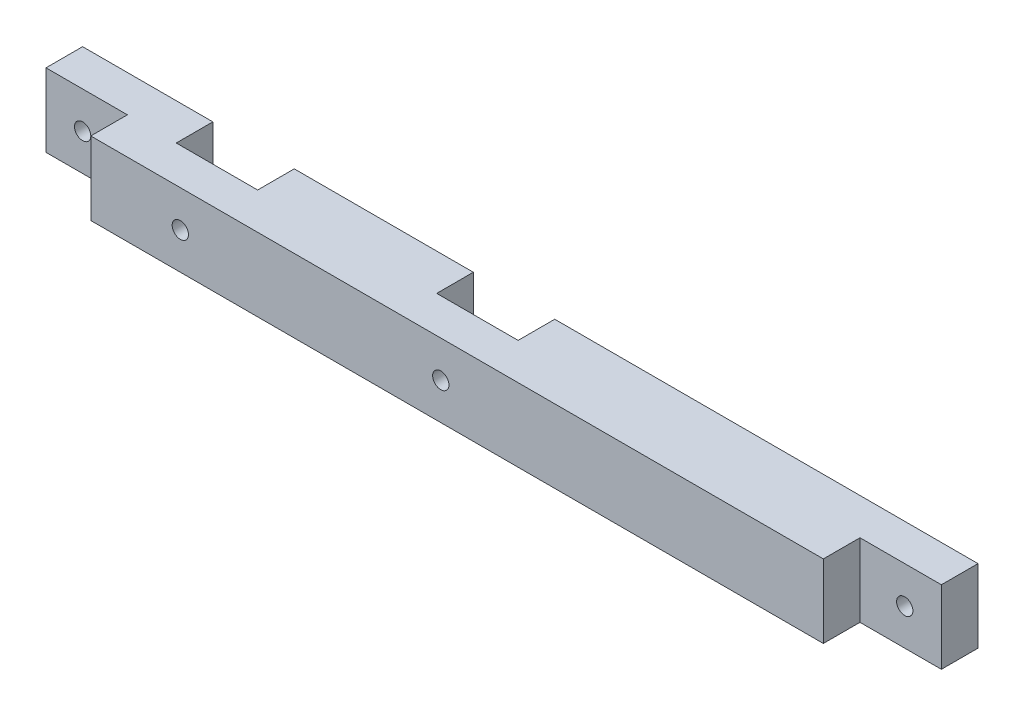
ISO-10303-21;
HEADER;
FILE_DESCRIPTION(('STEP AP214'),'2;1');
FILE_NAME('part.step','',(''),(''),'','','');
FILE_SCHEMA(('AUTOMOTIVE_DESIGN { 1 0 10303 214 1 1 1 1 }'));
ENDSEC;
DATA;
#1=APPLICATION_CONTEXT('core data for automotive mechanical design processes');
#2=APPLICATION_PROTOCOL_DEFINITION('international standard','automotive_design',2000,#1);
#3=PRODUCT_CONTEXT('',#1,'mechanical');
#4=PRODUCT('Part','Part','',(#3));
#5=PRODUCT_RELATED_PRODUCT_CATEGORY('part','',(#4));
#6=PRODUCT_DEFINITION_FORMATION('','',#4);
#7=PRODUCT_DEFINITION_CONTEXT('part definition',#1,'design');
#8=PRODUCT_DEFINITION('design','',#6,#7);
#9=PRODUCT_DEFINITION_SHAPE('','',#8);
#10=(LENGTH_UNIT() NAMED_UNIT(*) SI_UNIT(.MILLI.,.METRE.));
#11=(NAMED_UNIT(*) PLANE_ANGLE_UNIT() SI_UNIT($,.RADIAN.));
#12=(NAMED_UNIT(*) SI_UNIT($,.STERADIAN.) SOLID_ANGLE_UNIT());
#13=UNCERTAINTY_MEASURE_WITH_UNIT(LENGTH_MEASURE(1.E-05),#10,'distance_accuracy_value','');
#14=(GEOMETRIC_REPRESENTATION_CONTEXT(3) GLOBAL_UNCERTAINTY_ASSIGNED_CONTEXT((#13)) GLOBAL_UNIT_ASSIGNED_CONTEXT((#10,
#11,#12)) REPRESENTATION_CONTEXT('',''));
#15=CARTESIAN_POINT('',(0.,0.,0.));
#16=DIRECTION('',(0.,0.,1.));
#17=DIRECTION('',(1.,0.,0.));
#18=AXIS2_PLACEMENT_3D('',#15,#16,#17);
#19=CARTESIAN_POINT('',(-67.2716845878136,-100.617562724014,0.));
#20=DIRECTION('',(0.,0.,-1.));
#21=DIRECTION('',(-1.,0.,0.));
#22=AXIS2_PLACEMENT_3D('',#19,#20,#21);
#23=PLANE('',#22);
#24=DIRECTION('',(0.,1.,0.));
#25=VECTOR('',#24,1.);
#26=CARTESIAN_POINT('',(-19.2716845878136,-100.617562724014,0.));
#27=LINE('',#26,#25);
#28=CARTESIAN_POINT('',(-19.2716845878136,-109.617562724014,0.));
#29=VERTEX_POINT('',#28);
#30=CARTESIAN_POINT('',(-19.2716845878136,-100.617562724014,0.));
#31=VERTEX_POINT('',#30);
#32=EDGE_CURVE('E149',#29,#31,#27,.T.);
#33=ORIENTED_EDGE('',*,*,#32,.F.);
#34=DIRECTION('',(1.,0.,0.));
#35=VECTOR('',#34,1.);
#36=CARTESIAN_POINT('',(-67.2716845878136,-109.617562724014,0.));
#37=LINE('',#36,#35);
#38=CARTESIAN_POINT('',(-41.2716845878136,-109.617562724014,0.));
#39=VERTEX_POINT('',#38);
#40=EDGE_CURVE('E267',#39,#29,#37,.T.);
#41=ORIENTED_EDGE('',*,*,#40,.F.);
#42=DIRECTION('',(0.,-1.,0.));
#43=VECTOR('',#42,1.);
#44=CARTESIAN_POINT('',(-41.2716845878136,-100.617562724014,0.));
#45=LINE('',#44,#43);
#46=CARTESIAN_POINT('',(-41.2716845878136,-100.617562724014,0.));
#47=VERTEX_POINT('',#46);
#48=EDGE_CURVE('E184',#47,#39,#45,.T.);
#49=ORIENTED_EDGE('',*,*,#48,.F.);
#50=DIRECTION('',(-1.,0.,0.));
#51=VECTOR('',#50,1.);
#52=CARTESIAN_POINT('',(-67.2716845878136,-100.617562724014,0.));
#53=LINE('',#52,#51);
#54=EDGE_CURVE('E54',#31,#47,#53,.T.);
#55=ORIENTED_EDGE('',*,*,#54,.F.);
#56=EDGE_LOOP('',(#33,#41,#49,#55));
#57=FACE_BOUND('',#56,.T.);
#58=ADVANCED_FACE('F31',(#57),#23,.T.);
#59=DIRECTION('',(0.,1.,0.));
#60=VECTOR('',#59,1.);
#61=CARTESIAN_POINT('',(-51.2716845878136,-100.617562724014,0.));
#62=LINE('',#61,#60);
#63=CARTESIAN_POINT('',(-51.2716845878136,-109.617562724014,0.));
#64=VERTEX_POINT('',#63);
#65=CARTESIAN_POINT('',(-51.2716845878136,-100.617562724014,0.));
#66=VERTEX_POINT('',#65);
#67=EDGE_CURVE('E175',#64,#66,#62,.T.);
#68=ORIENTED_EDGE('',*,*,#67,.F.);
#69=CARTESIAN_POINT('',(-67.2716845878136,-109.617562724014,0.));
#70=VERTEX_POINT('',#69);
#71=EDGE_CURVE('E263',#70,#64,#37,.T.);
#72=ORIENTED_EDGE('',*,*,#71,.F.);
#73=DIRECTION('',(0.,-1.,0.));
#74=VECTOR('',#73,1.);
#75=CARTESIAN_POINT('',(-67.2716845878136,-109.617562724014,0.));
#76=LINE('',#75,#74);
#77=CARTESIAN_POINT('',(-67.2716845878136,-100.617562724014,0.));
#78=VERTEX_POINT('',#77);
#79=EDGE_CURVE('E251',#78,#70,#76,.T.);
#80=ORIENTED_EDGE('',*,*,#79,.F.);
#81=EDGE_CURVE('E270',#66,#78,#53,.T.);
#82=ORIENTED_EDGE('',*,*,#81,.F.);
#83=EDGE_LOOP('',(#68,#72,#80,#82));
#84=FACE_BOUND('',#83,.T.);
#85=CARTESIAN_POINT('',(-62.7716845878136,-105.117562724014,0.));
#86=DIRECTION('',(0.,0.,1.));
#87=DIRECTION('',(1.,0.,0.));
#88=AXIS2_PLACEMENT_3D('',#85,#86,#87);
#89=CIRCLE('',#88,0.999999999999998);
#90=CARTESIAN_POINT('',(-61.7716845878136,-105.117562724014,0.));
#91=VERTEX_POINT('',#90);
#92=EDGE_CURVE('E206',#91,#91,#89,.T.);
#93=ORIENTED_EDGE('',*,*,#92,.T.);
#94=EDGE_LOOP('',(#93));
#95=FACE_BOUND('',#94,.T.);
#96=ADVANCED_FACE('F318',(#84,#95),#23,.T.);
#97=CARTESIAN_POINT('',(42.7283154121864,-109.617562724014,9.));
#98=DIRECTION('',(-1.,0.,0.));
#99=DIRECTION('',(0.,0.,1.));
#100=AXIS2_PLACEMENT_3D('',#97,#98,#99);
#101=PLANE('',#100);
#102=DIRECTION('',(0.,1.,0.));
#103=VECTOR('',#102,1.);
#104=CARTESIAN_POINT('',(42.7283154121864,-109.617562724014,4.5));
#105=LINE('',#104,#103);
#106=CARTESIAN_POINT('',(42.7283154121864,-109.617562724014,4.5));
#107=VERTEX_POINT('',#106);
#108=CARTESIAN_POINT('',(42.7283154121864,-100.617562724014,4.5));
#109=VERTEX_POINT('',#108);
#110=EDGE_CURVE('E218',#107,#109,#105,.T.);
#111=ORIENTED_EDGE('',*,*,#110,.F.);
#112=DIRECTION('',(0.,0.,-1.));
#113=VECTOR('',#112,1.);
#114=CARTESIAN_POINT('',(42.7283154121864,-109.617562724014,9.));
#115=LINE('',#114,#113);
#116=CARTESIAN_POINT('',(42.7283154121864,-109.617562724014,0.));
#117=VERTEX_POINT('',#116);
#118=EDGE_CURVE('E39',#107,#117,#115,.T.);
#119=ORIENTED_EDGE('',*,*,#118,.T.);
#120=DIRECTION('',(0.,1.,0.));
#121=VECTOR('',#120,1.);
#122=CARTESIAN_POINT('',(42.7283154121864,-109.617562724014,0.));
#123=LINE('',#122,#121);
#124=CARTESIAN_POINT('',(42.7283154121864,-100.617562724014,0.));
#125=VERTEX_POINT('',#124);
#126=EDGE_CURVE('E266',#117,#125,#123,.T.);
#127=ORIENTED_EDGE('',*,*,#126,.T.);
#128=DIRECTION('',(0.,0.,-1.));
#129=VECTOR('',#128,1.);
#130=CARTESIAN_POINT('',(42.7283154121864,-100.617562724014,9.));
#131=LINE('',#130,#129);
#132=EDGE_CURVE('E274',#109,#125,#131,.T.);
#133=ORIENTED_EDGE('',*,*,#132,.F.);
#134=EDGE_LOOP('',(#111,#119,#127,#133));
#135=FACE_BOUND('',#134,.T.);
#136=ADVANCED_FACE('F280',(#135),#101,.F.);
#137=CARTESIAN_POINT('',(-67.2716845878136,-109.617562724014,9.));
#138=DIRECTION('',(1.,0.,0.));
#139=DIRECTION('',(0.,0.,-1.));
#140=AXIS2_PLACEMENT_3D('',#137,#138,#139);
#141=PLANE('',#140);
#142=DIRECTION('',(0.,0.,-1.));
#143=VECTOR('',#142,1.);
#144=CARTESIAN_POINT('',(-67.2716845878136,-109.617562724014,9.));
#145=LINE('',#144,#143);
#146=CARTESIAN_POINT('',(-67.2716845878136,-109.617562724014,4.5));
#147=VERTEX_POINT('',#146);
#148=EDGE_CURVE('E11',#147,#70,#145,.T.);
#149=ORIENTED_EDGE('',*,*,#148,.F.);
#150=DIRECTION('',(0.,-1.,0.));
#151=VECTOR('',#150,1.);
#152=CARTESIAN_POINT('',(-67.2716845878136,-109.617562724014,4.5));
#153=LINE('',#152,#151);
#154=CARTESIAN_POINT('',(-67.2716845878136,-100.617562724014,4.5));
#155=VERTEX_POINT('',#154);
#156=EDGE_CURVE('E235',#155,#147,#153,.T.);
#157=ORIENTED_EDGE('',*,*,#156,.F.);
#158=DIRECTION('',(0.,0.,-1.));
#159=VECTOR('',#158,1.);
#160=CARTESIAN_POINT('',(-67.2716845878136,-100.617562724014,9.));
#161=LINE('',#160,#159);
#162=EDGE_CURVE('E259',#155,#78,#161,.T.);
#163=ORIENTED_EDGE('',*,*,#162,.T.);
#164=ORIENTED_EDGE('',*,*,#79,.T.);
#165=EDGE_LOOP('',(#149,#157,#163,#164));
#166=FACE_BOUND('',#165,.T.);
#167=ADVANCED_FACE('F33',(#166),#141,.F.);
#168=CARTESIAN_POINT('',(-67.2716845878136,-109.617562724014,9.));
#169=DIRECTION('',(0.,1.,0.));
#170=DIRECTION('',(0.,0.,1.));
#171=AXIS2_PLACEMENT_3D('',#168,#169,#170);
#172=PLANE('',#171);
#173=ORIENTED_EDGE('',*,*,#40,.T.);
#174=DIRECTION('',(0.,0.,-1.));
#175=VECTOR('',#174,1.);
#176=CARTESIAN_POINT('',(-19.2716845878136,-109.617562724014,4.5));
#177=LINE('',#176,#175);
#178=CARTESIAN_POINT('',(-19.2716845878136,-109.617562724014,4.5));
#179=VERTEX_POINT('',#178);
#180=EDGE_CURVE('E173',#179,#29,#177,.T.);
#181=ORIENTED_EDGE('',*,*,#180,.F.);
#182=DIRECTION('',(-1.,0.,0.));
#183=VECTOR('',#182,1.);
#184=CARTESIAN_POINT('',(-19.2716845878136,-109.617562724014,4.5));
#185=LINE('',#184,#183);
#186=CARTESIAN_POINT('',(-9.27168458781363,-109.617562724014,4.5));
#187=VERTEX_POINT('',#186);
#188=EDGE_CURVE('E151',#187,#179,#185,.T.);
#189=ORIENTED_EDGE('',*,*,#188,.F.);
#190=DIRECTION('',(0.,0.,-1.));
#191=VECTOR('',#190,1.);
#192=CARTESIAN_POINT('',(-9.27168458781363,-109.617562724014,4.5));
#193=LINE('',#192,#191);
#194=CARTESIAN_POINT('',(-9.27168458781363,-109.617562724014,0.));
#195=VERTEX_POINT('',#194);
#196=EDGE_CURVE('E176',#187,#195,#193,.T.);
#197=ORIENTED_EDGE('',*,*,#196,.T.);
#198=EDGE_CURVE('E262',#195,#117,#37,.T.);
#199=ORIENTED_EDGE('',*,*,#198,.T.);
#200=ORIENTED_EDGE('',*,*,#118,.F.);
#201=DIRECTION('',(1.,0.,0.));
#202=VECTOR('',#201,1.);
#203=CARTESIAN_POINT('',(42.7283154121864,-109.617562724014,4.5));
#204=LINE('',#203,#202);
#205=CARTESIAN_POINT('',(32.7283154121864,-109.617562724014,4.5));
#206=VERTEX_POINT('',#205);
#207=EDGE_CURVE('E226',#206,#107,#204,.T.);
#208=ORIENTED_EDGE('',*,*,#207,.F.);
#209=DIRECTION('',(0.,0.,1.));
#210=VECTOR('',#209,1.);
#211=CARTESIAN_POINT('',(32.7283154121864,-109.617562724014,4.5));
#212=LINE('',#211,#210);
#213=CARTESIAN_POINT('',(32.7283154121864,-109.617562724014,9.));
#214=VERTEX_POINT('',#213);
#215=EDGE_CURVE('E230',#206,#214,#212,.T.);
#216=ORIENTED_EDGE('',*,*,#215,.T.);
#217=DIRECTION('',(1.,0.,0.));
#218=VECTOR('',#217,1.);
#219=CARTESIAN_POINT('',(-67.2716845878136,-109.617562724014,9.));
#220=LINE('',#219,#218);
#221=CARTESIAN_POINT('',(-57.2716845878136,-109.617562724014,9.));
#222=VERTEX_POINT('',#221);
#223=EDGE_CURVE('E253',#222,#214,#220,.T.);
#224=ORIENTED_EDGE('',*,*,#223,.F.);
#225=DIRECTION('',(0.,0.,1.));
#226=VECTOR('',#225,1.);
#227=CARTESIAN_POINT('',(-57.2716845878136,-109.617562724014,4.5));
#228=LINE('',#227,#226);
#229=CARTESIAN_POINT('',(-57.2716845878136,-109.617562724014,4.5));
#230=VERTEX_POINT('',#229);
#231=EDGE_CURVE('E245',#230,#222,#228,.T.);
#232=ORIENTED_EDGE('',*,*,#231,.F.);
#233=DIRECTION('',(1.,0.,0.));
#234=VECTOR('',#233,1.);
#235=CARTESIAN_POINT('',(-67.2716845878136,-109.617562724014,4.5));
#236=LINE('',#235,#234);
#237=EDGE_CURVE('E237',#147,#230,#236,.T.);
#238=ORIENTED_EDGE('',*,*,#237,.F.);
#239=ORIENTED_EDGE('',*,*,#148,.T.);
#240=ORIENTED_EDGE('',*,*,#71,.T.);
#241=DIRECTION('',(0.,0.,-1.));
#242=VECTOR('',#241,1.);
#243=CARTESIAN_POINT('',(-51.2716845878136,-109.617562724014,4.5));
#244=LINE('',#243,#242);
#245=CARTESIAN_POINT('',(-51.2716845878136,-109.617562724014,4.5));
#246=VERTEX_POINT('',#245);
#247=EDGE_CURVE('E196',#246,#64,#244,.T.);
#248=ORIENTED_EDGE('',*,*,#247,.F.);
#249=DIRECTION('',(-1.,0.,0.));
#250=VECTOR('',#249,1.);
#251=CARTESIAN_POINT('',(-51.2716845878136,-109.617562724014,4.5));
#252=LINE('',#251,#250);
#253=CARTESIAN_POINT('',(-41.2716845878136,-109.617562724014,4.5));
#254=VERTEX_POINT('',#253);
#255=EDGE_CURVE('E190',#254,#246,#252,.T.);
#256=ORIENTED_EDGE('',*,*,#255,.F.);
#257=DIRECTION('',(0.,0.,-1.));
#258=VECTOR('',#257,1.);
#259=CARTESIAN_POINT('',(-41.2716845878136,-109.617562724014,4.5));
#260=LINE('',#259,#258);
#261=EDGE_CURVE('E199',#254,#39,#260,.T.);
#262=ORIENTED_EDGE('',*,*,#261,.T.);
#263=EDGE_LOOP('',(#173,#181,#189,#197,#199,#200,#208,#216,#224,#232,#238,#239,#240,#248,#256,#262));
#264=FACE_BOUND('',#263,.T.);
#265=ADVANCED_FACE('F295',(#264),#172,.F.);
#266=CARTESIAN_POINT('',(-67.2716845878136,-100.617562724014,9.));
#267=DIRECTION('',(0.,-1.,0.));
#268=DIRECTION('',(0.,0.,-1.));
#269=AXIS2_PLACEMENT_3D('',#266,#267,#268);
#270=PLANE('',#269);
#271=DIRECTION('',(1.,0.,0.));
#272=VECTOR('',#271,1.);
#273=CARTESIAN_POINT('',(-19.2716845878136,-100.617562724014,4.5));
#274=LINE('',#273,#272);
#275=CARTESIAN_POINT('',(-19.2716845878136,-100.617562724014,4.5));
#276=VERTEX_POINT('',#275);
#277=CARTESIAN_POINT('',(-9.27168458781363,-100.617562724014,4.5));
#278=VERTEX_POINT('',#277);
#279=EDGE_CURVE('E157',#276,#278,#274,.T.);
#280=ORIENTED_EDGE('',*,*,#279,.F.);
#281=DIRECTION('',(0.,0.,-1.));
#282=VECTOR('',#281,1.);
#283=CARTESIAN_POINT('',(-19.2716845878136,-100.617562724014,4.5));
#284=LINE('',#283,#282);
#285=EDGE_CURVE('E143',#276,#31,#284,.T.);
#286=ORIENTED_EDGE('',*,*,#285,.T.);
#287=ORIENTED_EDGE('',*,*,#54,.T.);
#288=DIRECTION('',(0.,0.,-1.));
#289=VECTOR('',#288,1.);
#290=CARTESIAN_POINT('',(-41.2716845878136,-100.617562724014,4.5));
#291=LINE('',#290,#289);
#292=CARTESIAN_POINT('',(-41.2716845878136,-100.617562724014,4.5));
#293=VERTEX_POINT('',#292);
#294=EDGE_CURVE('E202',#293,#47,#291,.T.);
#295=ORIENTED_EDGE('',*,*,#294,.F.);
#296=DIRECTION('',(1.,0.,0.));
#297=VECTOR('',#296,1.);
#298=CARTESIAN_POINT('',(-51.2716845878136,-100.617562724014,4.5));
#299=LINE('',#298,#297);
#300=CARTESIAN_POINT('',(-51.2716845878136,-100.617562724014,4.5));
#301=VERTEX_POINT('',#300);
#302=EDGE_CURVE('E183',#301,#293,#299,.T.);
#303=ORIENTED_EDGE('',*,*,#302,.F.);
#304=DIRECTION('',(0.,0.,-1.));
#305=VECTOR('',#304,1.);
#306=CARTESIAN_POINT('',(-51.2716845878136,-100.617562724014,4.5));
#307=LINE('',#306,#305);
#308=EDGE_CURVE('E193',#301,#66,#307,.T.);
#309=ORIENTED_EDGE('',*,*,#308,.T.);
#310=ORIENTED_EDGE('',*,*,#81,.T.);
#311=ORIENTED_EDGE('',*,*,#162,.F.);
#312=DIRECTION('',(-1.,0.,0.));
#313=VECTOR('',#312,1.);
#314=CARTESIAN_POINT('',(-67.2716845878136,-100.617562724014,4.5));
#315=LINE('',#314,#313);
#316=CARTESIAN_POINT('',(-57.2716845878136,-100.617562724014,4.5));
#317=VERTEX_POINT('',#316);
#318=EDGE_CURVE('E243',#317,#155,#315,.T.);
#319=ORIENTED_EDGE('',*,*,#318,.F.);
#320=DIRECTION('',(0.,0.,1.));
#321=VECTOR('',#320,1.);
#322=CARTESIAN_POINT('',(-57.2716845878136,-100.617562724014,4.5));
#323=LINE('',#322,#321);
#324=CARTESIAN_POINT('',(-57.2716845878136,-100.617562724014,9.));
#325=VERTEX_POINT('',#324);
#326=EDGE_CURVE('E248',#317,#325,#323,.T.);
#327=ORIENTED_EDGE('',*,*,#326,.T.);
#328=DIRECTION('',(-1.,0.,0.));
#329=VECTOR('',#328,1.);
#330=CARTESIAN_POINT('',(-67.2716845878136,-100.617562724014,9.));
#331=LINE('',#330,#329);
#332=CARTESIAN_POINT('',(32.7283154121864,-100.617562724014,9.));
#333=VERTEX_POINT('',#332);
#334=EDGE_CURVE('E256',#333,#325,#331,.T.);
#335=ORIENTED_EDGE('',*,*,#334,.F.);
#336=DIRECTION('',(0.,0.,1.));
#337=VECTOR('',#336,1.);
#338=CARTESIAN_POINT('',(32.7283154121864,-100.617562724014,4.5));
#339=LINE('',#338,#337);
#340=CARTESIAN_POINT('',(32.7283154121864,-100.617562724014,4.5));
#341=VERTEX_POINT('',#340);
#342=EDGE_CURVE('E228',#341,#333,#339,.T.);
#343=ORIENTED_EDGE('',*,*,#342,.F.);
#344=DIRECTION('',(-1.,0.,0.));
#345=VECTOR('',#344,1.);
#346=CARTESIAN_POINT('',(42.7283154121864,-100.617562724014,4.5));
#347=LINE('',#346,#345);
#348=EDGE_CURVE('E220',#109,#341,#347,.T.);
#349=ORIENTED_EDGE('',*,*,#348,.F.);
#350=ORIENTED_EDGE('',*,*,#132,.T.);
#351=CARTESIAN_POINT('',(-9.27168458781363,-100.617562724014,0.));
#352=VERTEX_POINT('',#351);
#353=EDGE_CURVE('E257',#125,#352,#53,.T.);
#354=ORIENTED_EDGE('',*,*,#353,.T.);
#355=DIRECTION('',(0.,0.,-1.));
#356=VECTOR('',#355,1.);
#357=CARTESIAN_POINT('',(-9.27168458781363,-100.617562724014,4.5));
#358=LINE('',#357,#356);
#359=EDGE_CURVE('E46',#278,#352,#358,.T.);
#360=ORIENTED_EDGE('',*,*,#359,.F.);
#361=EDGE_LOOP('',(#280,#286,#287,#295,#303,#309,#310,#311,#319,#327,#335,#343,#349,#350,#354,#360));
#362=FACE_BOUND('',#361,.T.);
#363=ADVANCED_FACE('F162',(#362),#270,.F.);
#364=CARTESIAN_POINT('',(-67.2716845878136,-100.617562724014,9.));
#365=DIRECTION('',(0.,0.,-1.));
#366=DIRECTION('',(-1.,0.,0.));
#367=AXIS2_PLACEMENT_3D('',#364,#365,#366);
#368=PLANE('',#367);
#369=CARTESIAN_POINT('',(-46.2716845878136,-105.117562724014,9.));
#370=DIRECTION('',(0.,0.,-1.));
#371=DIRECTION('',(-1.,0.,0.));
#372=AXIS2_PLACEMENT_3D('',#369,#370,#371);
#373=CIRCLE('',#372,0.999999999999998);
#374=CARTESIAN_POINT('',(-47.2716845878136,-105.117562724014,9.));
#375=VERTEX_POINT('',#374);
#376=EDGE_CURVE('E392',#375,#375,#373,.T.);
#377=ORIENTED_EDGE('',*,*,#376,.T.);
#378=EDGE_LOOP('',(#377));
#379=FACE_BOUND('',#378,.T.);
#380=CARTESIAN_POINT('',(-14.2716845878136,-105.117562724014,9.));
#381=DIRECTION('',(0.,0.,-1.));
#382=DIRECTION('',(-1.,0.,0.));
#383=AXIS2_PLACEMENT_3D('',#380,#381,#382);
#384=CIRCLE('',#383,1.);
#385=CARTESIAN_POINT('',(-15.2716845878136,-105.117562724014,9.));
#386=VERTEX_POINT('',#385);
#387=EDGE_CURVE('E171',#386,#386,#384,.T.);
#388=ORIENTED_EDGE('',*,*,#387,.T.);
#389=EDGE_LOOP('',(#388));
#390=FACE_BOUND('',#389,.T.);
#391=ORIENTED_EDGE('',*,*,#223,.T.);
#392=DIRECTION('',(0.,-1.,0.));
#393=VECTOR('',#392,1.);
#394=CARTESIAN_POINT('',(32.7283154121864,-109.617562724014,9.));
#395=LINE('',#394,#393);
#396=EDGE_CURVE('E215',#333,#214,#395,.T.);
#397=ORIENTED_EDGE('',*,*,#396,.F.);
#398=ORIENTED_EDGE('',*,*,#334,.T.);
#399=DIRECTION('',(0.,1.,0.));
#400=VECTOR('',#399,1.);
#401=CARTESIAN_POINT('',(-57.2716845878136,-109.617562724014,9.));
#402=LINE('',#401,#400);
#403=EDGE_CURVE('E233',#222,#325,#402,.T.);
#404=ORIENTED_EDGE('',*,*,#403,.F.);
#405=EDGE_LOOP('',(#391,#397,#398,#404));
#406=FACE_BOUND('',#405,.T.);
#407=ADVANCED_FACE('F302',(#379,#390,#406),#368,.F.);
#408=DIRECTION('',(0.,-1.,0.));
#409=VECTOR('',#408,1.);
#410=CARTESIAN_POINT('',(-9.27168458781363,-100.617562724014,0.));
#411=LINE('',#410,#409);
#412=EDGE_CURVE('E160',#352,#195,#411,.T.);
#413=ORIENTED_EDGE('',*,*,#412,.F.);
#414=ORIENTED_EDGE('',*,*,#353,.F.);
#415=ORIENTED_EDGE('',*,*,#126,.F.);
#416=ORIENTED_EDGE('',*,*,#198,.F.);
#417=EDGE_LOOP('',(#413,#414,#415,#416));
#418=FACE_BOUND('',#417,.T.);
#419=CARTESIAN_POINT('',(38.2284017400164,-105.145436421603,0.));
#420=DIRECTION('',(0.,0.,1.));
#421=DIRECTION('',(1.,0.,0.));
#422=AXIS2_PLACEMENT_3D('',#419,#420,#421);
#423=CIRCLE('',#422,0.999999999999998);
#424=CARTESIAN_POINT('',(39.2284017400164,-105.145436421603,0.));
#425=VERTEX_POINT('',#424);
#426=EDGE_CURVE('E212',#425,#425,#423,.T.);
#427=ORIENTED_EDGE('',*,*,#426,.T.);
#428=EDGE_LOOP('',(#427));
#429=FACE_BOUND('',#428,.T.);
#430=ADVANCED_FACE('F287',(#418,#429),#23,.T.);
#431=CARTESIAN_POINT('',(-57.2716845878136,-109.617562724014,4.5));
#432=DIRECTION('',(1.,0.,0.));
#433=DIRECTION('',(0.,1.,0.));
#434=AXIS2_PLACEMENT_3D('',#431,#432,#433);
#435=PLANE('',#434);
#436=ORIENTED_EDGE('',*,*,#403,.T.);
#437=ORIENTED_EDGE('',*,*,#326,.F.);
#438=DIRECTION('',(0.,1.,0.));
#439=VECTOR('',#438,1.);
#440=CARTESIAN_POINT('',(-57.2716845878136,-109.617562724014,4.5));
#441=LINE('',#440,#439);
#442=EDGE_CURVE('E240',#230,#317,#441,.T.);
#443=ORIENTED_EDGE('',*,*,#442,.F.);
#444=ORIENTED_EDGE('',*,*,#231,.T.);
#445=EDGE_LOOP('',(#436,#437,#443,#444));
#446=FACE_BOUND('',#445,.T.);
#447=ADVANCED_FACE('F304',(#446),#435,.F.);
#448=CARTESIAN_POINT('',(-67.2716845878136,-100.617562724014,4.5));
#449=DIRECTION('',(0.,0.,-1.));
#450=DIRECTION('',(-1.,0.,0.));
#451=AXIS2_PLACEMENT_3D('',#448,#449,#450);
#452=PLANE('',#451);
#453=CARTESIAN_POINT('',(-62.7716845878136,-105.117562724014,4.5));
#454=DIRECTION('',(0.,0.,1.));
#455=DIRECTION('',(1.,0.,0.));
#456=AXIS2_PLACEMENT_3D('',#453,#454,#455);
#457=CIRCLE('',#456,0.999999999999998);
#458=CARTESIAN_POINT('',(-61.7716845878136,-105.117562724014,4.5));
#459=VERTEX_POINT('',#458);
#460=EDGE_CURVE('E198',#459,#459,#457,.T.);
#461=ORIENTED_EDGE('',*,*,#460,.F.);
#462=EDGE_LOOP('',(#461));
#463=FACE_BOUND('',#462,.T.);
#464=ORIENTED_EDGE('',*,*,#156,.T.);
#465=ORIENTED_EDGE('',*,*,#237,.T.);
#466=ORIENTED_EDGE('',*,*,#442,.T.);
#467=ORIENTED_EDGE('',*,*,#318,.T.);
#468=EDGE_LOOP('',(#464,#465,#466,#467));
#469=FACE_BOUND('',#468,.T.);
#470=ADVANCED_FACE('F309',(#463,#469),#452,.F.);
#471=CARTESIAN_POINT('',(32.7283154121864,-109.617562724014,4.5));
#472=DIRECTION('',(-1.,0.,0.));
#473=DIRECTION('',(0.,0.,1.));
#474=AXIS2_PLACEMENT_3D('',#471,#472,#473);
#475=PLANE('',#474);
#476=ORIENTED_EDGE('',*,*,#396,.T.);
#477=ORIENTED_EDGE('',*,*,#215,.F.);
#478=DIRECTION('',(0.,-1.,0.));
#479=VECTOR('',#478,1.);
#480=CARTESIAN_POINT('',(32.7283154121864,-109.617562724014,4.5));
#481=LINE('',#480,#479);
#482=EDGE_CURVE('E223',#341,#206,#481,.T.);
#483=ORIENTED_EDGE('',*,*,#482,.F.);
#484=ORIENTED_EDGE('',*,*,#342,.T.);
#485=EDGE_LOOP('',(#476,#477,#483,#484));
#486=FACE_BOUND('',#485,.T.);
#487=ADVANCED_FACE('F364',(#486),#475,.F.);
#488=CARTESIAN_POINT('',(42.7283154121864,-100.617562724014,4.5));
#489=DIRECTION('',(0.,0.,1.));
#490=DIRECTION('',(1.,0.,0.));
#491=AXIS2_PLACEMENT_3D('',#488,#489,#490);
#492=PLANE('',#491);
#493=CARTESIAN_POINT('',(38.2284017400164,-105.145436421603,4.5));
#494=DIRECTION('',(0.,0.,1.));
#495=DIRECTION('',(1.,0.,0.));
#496=AXIS2_PLACEMENT_3D('',#493,#494,#495);
#497=CIRCLE('',#496,0.999999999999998);
#498=CARTESIAN_POINT('',(39.2284017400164,-105.145436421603,4.5));
#499=VERTEX_POINT('',#498);
#500=EDGE_CURVE('E209',#499,#499,#497,.T.);
#501=ORIENTED_EDGE('',*,*,#500,.F.);
#502=EDGE_LOOP('',(#501));
#503=FACE_BOUND('',#502,.T.);
#504=ORIENTED_EDGE('',*,*,#110,.T.);
#505=ORIENTED_EDGE('',*,*,#348,.T.);
#506=ORIENTED_EDGE('',*,*,#482,.T.);
#507=ORIENTED_EDGE('',*,*,#207,.T.);
#508=EDGE_LOOP('',(#504,#505,#506,#507));
#509=FACE_BOUND('',#508,.T.);
#510=ADVANCED_FACE('F293',(#503,#509),#492,.T.);
#511=CARTESIAN_POINT('',(38.2284017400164,-105.145436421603,0.));
#512=DIRECTION('',(0.,0.,1.));
#513=DIRECTION('',(1.,0.,0.));
#514=AXIS2_PLACEMENT_3D('',#511,#512,#513);
#515=CYLINDRICAL_SURFACE('',#514,0.999999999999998);
#516=ORIENTED_EDGE('',*,*,#426,.F.);
#517=EDGE_LOOP('',(#516));
#518=FACE_BOUND('',#517,.T.);
#519=ORIENTED_EDGE('',*,*,#500,.T.);
#520=EDGE_LOOP('',(#519));
#521=FACE_BOUND('',#520,.T.);
#522=ADVANCED_FACE('F370',(#518,#521),#515,.F.);
#523=CARTESIAN_POINT('',(-62.7716845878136,-105.117562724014,0.));
#524=DIRECTION('',(0.,0.,1.));
#525=DIRECTION('',(1.,0.,0.));
#526=AXIS2_PLACEMENT_3D('',#523,#524,#525);
#527=CYLINDRICAL_SURFACE('',#526,0.999999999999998);
#528=ORIENTED_EDGE('',*,*,#92,.F.);
#529=EDGE_LOOP('',(#528));
#530=FACE_BOUND('',#529,.T.);
#531=ORIENTED_EDGE('',*,*,#460,.T.);
#532=EDGE_LOOP('',(#531));
#533=FACE_BOUND('',#532,.T.);
#534=ADVANCED_FACE('F374',(#530,#533),#527,.F.);
#535=CARTESIAN_POINT('',(-51.2716845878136,-100.617562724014,4.5));
#536=DIRECTION('',(-1.,0.,0.));
#537=DIRECTION('',(0.,0.,1.));
#538=AXIS2_PLACEMENT_3D('',#535,#536,#537);
#539=PLANE('',#538);
#540=ORIENTED_EDGE('',*,*,#67,.T.);
#541=ORIENTED_EDGE('',*,*,#308,.F.);
#542=DIRECTION('',(0.,1.,0.));
#543=VECTOR('',#542,1.);
#544=CARTESIAN_POINT('',(-51.2716845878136,-100.617562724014,4.5));
#545=LINE('',#544,#543);
#546=EDGE_CURVE('E180',#246,#301,#545,.T.);
#547=ORIENTED_EDGE('',*,*,#546,.F.);
#548=ORIENTED_EDGE('',*,*,#247,.T.);
#549=EDGE_LOOP('',(#540,#541,#547,#548));
#550=FACE_BOUND('',#549,.T.);
#551=ADVANCED_FACE('F322',(#550),#539,.F.);
#552=CARTESIAN_POINT('',(-41.2716845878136,-100.617562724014,4.5));
#553=DIRECTION('',(1.,0.,0.));
#554=DIRECTION('',(0.,1.,0.));
#555=AXIS2_PLACEMENT_3D('',#552,#553,#554);
#556=PLANE('',#555);
#557=ORIENTED_EDGE('',*,*,#48,.T.);
#558=ORIENTED_EDGE('',*,*,#261,.F.);
#559=DIRECTION('',(0.,-1.,0.));
#560=VECTOR('',#559,1.);
#561=CARTESIAN_POINT('',(-41.2716845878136,-100.617562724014,4.5));
#562=LINE('',#561,#560);
#563=EDGE_CURVE('E187',#293,#254,#562,.T.);
#564=ORIENTED_EDGE('',*,*,#563,.F.);
#565=ORIENTED_EDGE('',*,*,#294,.T.);
#566=EDGE_LOOP('',(#557,#558,#564,#565));
#567=FACE_BOUND('',#566,.T.);
#568=ADVANCED_FACE('F381',(#567),#556,.F.);
#569=CARTESIAN_POINT('',(-51.2716845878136,-109.617562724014,4.5));
#570=DIRECTION('',(0.,0.,1.));
#571=DIRECTION('',(1.,0.,0.));
#572=AXIS2_PLACEMENT_3D('',#569,#570,#571);
#573=PLANE('',#572);
#574=CARTESIAN_POINT('',(-46.2716845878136,-105.117562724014,4.5));
#575=DIRECTION('',(0.,0.,-1.));
#576=DIRECTION('',(-1.,0.,0.));
#577=AXIS2_PLACEMENT_3D('',#574,#575,#576);
#578=CIRCLE('',#577,0.999999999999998);
#579=CARTESIAN_POINT('',(-47.2716845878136,-105.117562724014,4.5));
#580=VERTEX_POINT('',#579);
#581=EDGE_CURVE('E390',#580,#580,#578,.T.);
#582=ORIENTED_EDGE('',*,*,#581,.F.);
#583=EDGE_LOOP('',(#582));
#584=FACE_BOUND('',#583,.T.);
#585=ORIENTED_EDGE('',*,*,#546,.T.);
#586=ORIENTED_EDGE('',*,*,#302,.T.);
#587=ORIENTED_EDGE('',*,*,#563,.T.);
#588=ORIENTED_EDGE('',*,*,#255,.T.);
#589=EDGE_LOOP('',(#585,#586,#587,#588));
#590=FACE_BOUND('',#589,.T.);
#591=ADVANCED_FACE('F325',(#584,#590),#573,.F.);
#592=CARTESIAN_POINT('',(-19.2716845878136,-100.617562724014,4.5));
#593=DIRECTION('',(-1.,0.,0.));
#594=DIRECTION('',(0.,0.,1.));
#595=AXIS2_PLACEMENT_3D('',#592,#593,#594);
#596=PLANE('',#595);
#597=ORIENTED_EDGE('',*,*,#32,.T.);
#598=ORIENTED_EDGE('',*,*,#285,.F.);
#599=DIRECTION('',(0.,1.,0.));
#600=VECTOR('',#599,1.);
#601=CARTESIAN_POINT('',(-19.2716845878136,-100.617562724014,4.5));
#602=LINE('',#601,#600);
#603=EDGE_CURVE('E146',#179,#276,#602,.T.);
#604=ORIENTED_EDGE('',*,*,#603,.F.);
#605=ORIENTED_EDGE('',*,*,#180,.T.);
#606=EDGE_LOOP('',(#597,#598,#604,#605));
#607=FACE_BOUND('',#606,.T.);
#608=ADVANCED_FACE('F145',(#607),#596,.F.);
#609=CARTESIAN_POINT('',(-9.27168458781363,-100.617562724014,4.5));
#610=DIRECTION('',(1.,0.,0.));
#611=DIRECTION('',(0.,1.,0.));
#612=AXIS2_PLACEMENT_3D('',#609,#610,#611);
#613=PLANE('',#612);
#614=ORIENTED_EDGE('',*,*,#412,.T.);
#615=ORIENTED_EDGE('',*,*,#196,.F.);
#616=DIRECTION('',(0.,-1.,0.));
#617=VECTOR('',#616,1.);
#618=CARTESIAN_POINT('',(-9.27168458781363,-100.617562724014,4.5));
#619=LINE('',#618,#617);
#620=EDGE_CURVE('E164',#278,#187,#619,.T.);
#621=ORIENTED_EDGE('',*,*,#620,.F.);
#622=ORIENTED_EDGE('',*,*,#359,.T.);
#623=EDGE_LOOP('',(#614,#615,#621,#622));
#624=FACE_BOUND('',#623,.T.);
#625=ADVANCED_FACE('F331',(#624),#613,.F.);
#626=CARTESIAN_POINT('',(-19.2716845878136,-109.617562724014,4.5));
#627=DIRECTION('',(0.,0.,1.));
#628=DIRECTION('',(1.,0.,0.));
#629=AXIS2_PLACEMENT_3D('',#626,#627,#628);
#630=PLANE('',#629);
#631=CARTESIAN_POINT('',(-14.2716845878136,-105.117562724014,4.5));
#632=DIRECTION('',(0.,0.,-1.));
#633=DIRECTION('',(-1.,0.,0.));
#634=AXIS2_PLACEMENT_3D('',#631,#632,#633);
#635=CIRCLE('',#634,1.);
#636=CARTESIAN_POINT('',(-15.2716845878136,-105.117562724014,4.5));
#637=VERTEX_POINT('',#636);
#638=EDGE_CURVE('E394',#637,#637,#635,.T.);
#639=ORIENTED_EDGE('',*,*,#638,.F.);
#640=EDGE_LOOP('',(#639));
#641=FACE_BOUND('',#640,.T.);
#642=ORIENTED_EDGE('',*,*,#603,.T.);
#643=ORIENTED_EDGE('',*,*,#279,.T.);
#644=ORIENTED_EDGE('',*,*,#620,.T.);
#645=ORIENTED_EDGE('',*,*,#188,.T.);
#646=EDGE_LOOP('',(#642,#643,#644,#645));
#647=FACE_BOUND('',#646,.T.);
#648=ADVANCED_FACE('F155',(#641,#647),#630,.F.);
#649=CARTESIAN_POINT('',(-14.2716845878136,-105.117562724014,9.));
#650=DIRECTION('',(0.,0.,-1.));
#651=DIRECTION('',(-1.,0.,0.));
#652=AXIS2_PLACEMENT_3D('',#649,#650,#651);
#653=CYLINDRICAL_SURFACE('',#652,1.);
#654=ORIENTED_EDGE('',*,*,#387,.F.);
#655=EDGE_LOOP('',(#654));
#656=FACE_BOUND('',#655,.T.);
#657=ORIENTED_EDGE('',*,*,#638,.T.);
#658=EDGE_LOOP('',(#657));
#659=FACE_BOUND('',#658,.T.);
#660=ADVANCED_FACE('F338',(#656,#659),#653,.F.);
#661=CARTESIAN_POINT('',(-46.2716845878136,-105.117562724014,9.));
#662=DIRECTION('',(0.,0.,-1.));
#663=DIRECTION('',(-1.,0.,0.));
#664=AXIS2_PLACEMENT_3D('',#661,#662,#663);
#665=CYLINDRICAL_SURFACE('',#664,0.999999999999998);
#666=ORIENTED_EDGE('',*,*,#376,.F.);
#667=EDGE_LOOP('',(#666));
#668=FACE_BOUND('',#667,.T.);
#669=ORIENTED_EDGE('',*,*,#581,.T.);
#670=EDGE_LOOP('',(#669));
#671=FACE_BOUND('',#670,.T.);
#672=ADVANCED_FACE('F402',(#668,#671),#665,.F.);
#673=CLOSED_SHELL('',(#58,#96,#136,#167,#265,#363,#407,#430,#447,#470,#487,#510,#522,#534,#551,
#568,#591,#608,#625,#648,#660,#672));
#674=MANIFOLD_SOLID_BREP('B2',#673);
#675=ADVANCED_BREP_SHAPE_REPRESENTATION('',(#18,#674),#14);
#676=SHAPE_DEFINITION_REPRESENTATION(#9,#675);
ENDSEC;
END-ISO-10303-21;
